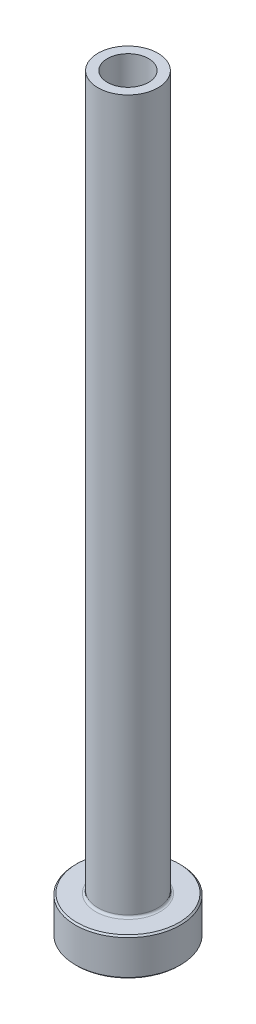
ISO-10303-21;
HEADER;
FILE_DESCRIPTION(('STEP AP214'),'2;1');
FILE_NAME('part.step','',(''),(''),'','','');
FILE_SCHEMA(('AUTOMOTIVE_DESIGN { 1 0 10303 214 1 1 1 1 }'));
ENDSEC;
DATA;
#1=APPLICATION_CONTEXT('core data for automotive mechanical design processes');
#2=APPLICATION_PROTOCOL_DEFINITION('international standard','automotive_design',2000,#1);
#3=PRODUCT_CONTEXT('',#1,'mechanical');
#4=PRODUCT('Part','Part','',(#3));
#5=PRODUCT_RELATED_PRODUCT_CATEGORY('part','',(#4));
#6=PRODUCT_DEFINITION_FORMATION('','',#4);
#7=PRODUCT_DEFINITION_CONTEXT('part definition',#1,'design');
#8=PRODUCT_DEFINITION('design','',#6,#7);
#9=PRODUCT_DEFINITION_SHAPE('','',#8);
#10=(LENGTH_UNIT() NAMED_UNIT(*) SI_UNIT(.MILLI.,.METRE.));
#11=(NAMED_UNIT(*) PLANE_ANGLE_UNIT() SI_UNIT($,.RADIAN.));
#12=(NAMED_UNIT(*) SI_UNIT($,.STERADIAN.) SOLID_ANGLE_UNIT());
#13=UNCERTAINTY_MEASURE_WITH_UNIT(LENGTH_MEASURE(1.E-05),#10,'distance_accuracy_value','');
#14=(GEOMETRIC_REPRESENTATION_CONTEXT(3) GLOBAL_UNCERTAINTY_ASSIGNED_CONTEXT((#13)) GLOBAL_UNIT_ASSIGNED_CONTEXT((#10,
#11,#12)) REPRESENTATION_CONTEXT('',''));
#15=CARTESIAN_POINT('',(0.,0.,0.));
#16=DIRECTION('',(0.,0.,1.));
#17=DIRECTION('',(1.,0.,0.));
#18=AXIS2_PLACEMENT_3D('',#15,#16,#17);
#19=CARTESIAN_POINT('',(0.,92.1876809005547,0.));
#20=DIRECTION('',(0.,1.,0.));
#21=DIRECTION('',(0.,0.,1.));
#22=AXIS2_PLACEMENT_3D('',#19,#20,#21);
#23=CYLINDRICAL_SURFACE('',#22,2.74999999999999);
#24=CARTESIAN_POINT('',(0.,100.,0.));
#25=DIRECTION('',(0.,1.,0.));
#26=DIRECTION('',(0.,0.,1.));
#27=AXIS2_PLACEMENT_3D('',#24,#25,#26);
#28=CIRCLE('',#27,2.74999999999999);
#29=CARTESIAN_POINT('',(0.,100.,2.74999999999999));
#30=VERTEX_POINT('',#29);
#31=EDGE_CURVE('E62',#30,#30,#28,.T.);
#32=ORIENTED_EDGE('',*,*,#31,.T.);
#33=EDGE_LOOP('',(#32));
#34=FACE_BOUND('',#33,.T.);
#35=CARTESIAN_POINT('',(0.,55.,0.));
#36=DIRECTION('',(0.,1.,0.));
#37=DIRECTION('',(0.,0.,1.));
#38=AXIS2_PLACEMENT_3D('',#35,#36,#37);
#39=CIRCLE('',#38,2.74999999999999);
#40=CARTESIAN_POINT('',(0.,55.,2.74999999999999));
#41=VERTEX_POINT('',#40);
#42=EDGE_CURVE('E71',#41,#41,#39,.T.);
#43=ORIENTED_EDGE('',*,*,#42,.F.);
#44=EDGE_LOOP('',(#43));
#45=FACE_BOUND('',#44,.T.);
#46=ADVANCED_FACE('F30',(#34,#45),#23,.F.);
#47=CARTESIAN_POINT('',(-2.74999999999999,100.,0.));
#48=DIRECTION('',(0.,1.,0.));
#49=DIRECTION('',(0.,0.,1.));
#50=AXIS2_PLACEMENT_3D('',#47,#48,#49);
#51=PLANE('',#50);
#52=CARTESIAN_POINT('',(0.,100.,0.));
#53=DIRECTION('',(0.,1.,0.));
#54=DIRECTION('',(0.,0.,1.));
#55=AXIS2_PLACEMENT_3D('',#52,#53,#54);
#56=CIRCLE('',#55,4.);
#57=CARTESIAN_POINT('',(0.,100.,4.));
#58=VERTEX_POINT('',#57);
#59=EDGE_CURVE('E65',#58,#58,#56,.T.);
#60=ORIENTED_EDGE('',*,*,#59,.T.);
#61=EDGE_LOOP('',(#60));
#62=FACE_BOUND('',#61,.T.);
#63=ORIENTED_EDGE('',*,*,#31,.F.);
#64=EDGE_LOOP('',(#63));
#65=FACE_BOUND('',#64,.T.);
#66=ADVANCED_FACE('F79',(#62,#65),#51,.T.);
#67=CARTESIAN_POINT('',(0.,92.1876809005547,0.));
#68=DIRECTION('',(0.,1.,0.));
#69=DIRECTION('',(0.,0.,1.));
#70=AXIS2_PLACEMENT_3D('',#67,#68,#69);
#71=CYLINDRICAL_SURFACE('',#70,4.);
#72=CARTESIAN_POINT('',(0.,5.3,0.));
#73=DIRECTION('',(0.,1.,0.));
#74=DIRECTION('',(0.,0.,1.));
#75=AXIS2_PLACEMENT_3D('',#72,#73,#74);
#76=CIRCLE('',#75,4.);
#77=CARTESIAN_POINT('',(0.,5.3,4.));
#78=VERTEX_POINT('',#77);
#79=EDGE_CURVE('E59',#78,#78,#76,.T.);
#80=ORIENTED_EDGE('',*,*,#79,.T.);
#81=EDGE_LOOP('',(#80));
#82=FACE_BOUND('',#81,.T.);
#83=ORIENTED_EDGE('',*,*,#59,.F.);
#84=EDGE_LOOP('',(#83));
#85=FACE_BOUND('',#84,.T.);
#86=ADVANCED_FACE('F85',(#82,#85),#71,.T.);
#87=CARTESIAN_POINT('',(-3.99999999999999,5.,0.));
#88=DIRECTION('',(0.,1.,0.));
#89=DIRECTION('',(0.,0.,1.));
#90=AXIS2_PLACEMENT_3D('',#87,#88,#89);
#91=PLANE('',#90);
#92=CARTESIAN_POINT('',(0.,5.,0.));
#93=DIRECTION('',(0.,1.,0.));
#94=DIRECTION('',(0.,0.,1.));
#95=AXIS2_PLACEMENT_3D('',#92,#93,#94);
#96=CIRCLE('',#95,6.79999999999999);
#97=CARTESIAN_POINT('',(0.,5.,6.79999999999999));
#98=VERTEX_POINT('',#97);
#99=EDGE_CURVE('E53',#98,#98,#96,.T.);
#100=ORIENTED_EDGE('',*,*,#99,.T.);
#101=EDGE_LOOP('',(#100));
#102=FACE_BOUND('',#101,.T.);
#103=CARTESIAN_POINT('',(0.,5.,0.));
#104=DIRECTION('',(0.,1.,0.));
#105=DIRECTION('',(0.,0.,1.));
#106=AXIS2_PLACEMENT_3D('',#103,#104,#105);
#107=CIRCLE('',#106,4.3);
#108=CARTESIAN_POINT('',(0.,5.,4.3));
#109=VERTEX_POINT('',#108);
#110=EDGE_CURVE('E56',#109,#109,#107,.F.);
#111=ORIENTED_EDGE('',*,*,#110,.T.);
#112=EDGE_LOOP('',(#111));
#113=FACE_BOUND('',#112,.T.);
#114=ADVANCED_FACE('F111',(#102,#113),#91,.T.);
#115=CARTESIAN_POINT('',(0.,92.1876809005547,0.));
#116=DIRECTION('',(0.,1.,0.));
#117=DIRECTION('',(0.,0.,1.));
#118=AXIS2_PLACEMENT_3D('',#115,#116,#117);
#119=CYLINDRICAL_SURFACE('',#118,6.99999999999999);
#120=CARTESIAN_POINT('',(0.,4.8,0.));
#121=DIRECTION('',(0.,1.,0.));
#122=DIRECTION('',(0.,0.,1.));
#123=AXIS2_PLACEMENT_3D('',#120,#121,#122);
#124=CIRCLE('',#123,6.99999999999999);
#125=CARTESIAN_POINT('',(0.,4.8,6.99999999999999));
#126=VERTEX_POINT('',#125);
#127=EDGE_CURVE('E45',#126,#126,#124,.F.);
#128=ORIENTED_EDGE('',*,*,#127,.T.);
#129=EDGE_LOOP('',(#128));
#130=FACE_BOUND('',#129,.T.);
#131=CARTESIAN_POINT('',(0.,0.199999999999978,0.));
#132=DIRECTION('',(0.,-1.,0.));
#133=DIRECTION('',(0.,0.,-1.));
#134=AXIS2_PLACEMENT_3D('',#131,#132,#133);
#135=CIRCLE('',#134,6.99999999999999);
#136=CARTESIAN_POINT('',(0.,0.199999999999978,6.99999999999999));
#137=VERTEX_POINT('',#136);
#138=EDGE_CURVE('E50',#137,#137,#135,.F.);
#139=ORIENTED_EDGE('',*,*,#138,.T.);
#140=EDGE_LOOP('',(#139));
#141=FACE_BOUND('',#140,.T.);
#142=ADVANCED_FACE('F108',(#130,#141),#119,.T.);
#143=CARTESIAN_POINT('',(-6.99999999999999,0.,0.));
#144=DIRECTION('',(0.,-1.,0.));
#145=DIRECTION('',(0.,0.,-1.));
#146=AXIS2_PLACEMENT_3D('',#143,#144,#145);
#147=PLANE('',#146);
#148=CARTESIAN_POINT('',(0.,0.,0.));
#149=DIRECTION('',(0.,-1.,0.));
#150=DIRECTION('',(0.,0.,-1.));
#151=AXIS2_PLACEMENT_3D('',#148,#149,#150);
#152=CIRCLE('',#151,3.49999999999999);
#153=CARTESIAN_POINT('',(0.,0.,-3.49999999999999));
#154=VERTEX_POINT('',#153);
#155=EDGE_CURVE('E37',#154,#154,#152,.F.);
#156=ORIENTED_EDGE('',*,*,#155,.T.);
#157=EDGE_LOOP('',(#156));
#158=FACE_BOUND('',#157,.T.);
#159=CARTESIAN_POINT('',(0.,0.,0.));
#160=DIRECTION('',(0.,-1.,0.));
#161=DIRECTION('',(0.,0.,-1.));
#162=AXIS2_PLACEMENT_3D('',#159,#160,#161);
#163=CIRCLE('',#162,6.80000000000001);
#164=CARTESIAN_POINT('',(0.,0.,6.80000000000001));
#165=VERTEX_POINT('',#164);
#166=EDGE_CURVE('E41',#165,#165,#163,.T.);
#167=ORIENTED_EDGE('',*,*,#166,.T.);
#168=EDGE_LOOP('',(#167));
#169=FACE_BOUND('',#168,.T.);
#170=ADVANCED_FACE('F110',(#158,#169),#147,.T.);
#171=CARTESIAN_POINT('',(0.,92.1876809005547,0.));
#172=DIRECTION('',(0.,1.,0.));
#173=DIRECTION('',(0.,0.,1.));
#174=AXIS2_PLACEMENT_3D('',#171,#172,#173);
#175=CYLINDRICAL_SURFACE('',#174,2.99999999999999);
#176=CARTESIAN_POINT('',(0.,0.5,0.));
#177=DIRECTION('',(0.,-1.,0.));
#178=DIRECTION('',(0.,0.,-1.));
#179=AXIS2_PLACEMENT_3D('',#176,#177,#178);
#180=CIRCLE('',#179,2.99999999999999);
#181=CARTESIAN_POINT('',(0.,0.5,-2.99999999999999));
#182=VERTEX_POINT('',#181);
#183=EDGE_CURVE('E10',#182,#182,#180,.T.);
#184=ORIENTED_EDGE('',*,*,#183,.T.);
#185=EDGE_LOOP('',(#184));
#186=FACE_BOUND('',#185,.T.);
#187=CARTESIAN_POINT('',(0.,43.,0.));
#188=DIRECTION('',(0.,1.,0.));
#189=DIRECTION('',(0.,0.,1.));
#190=AXIS2_PLACEMENT_3D('',#187,#188,#189);
#191=CIRCLE('',#190,3.);
#192=CARTESIAN_POINT('',(0.,43.,3.));
#193=VERTEX_POINT('',#192);
#194=EDGE_CURVE('E68',#193,#193,#191,.T.);
#195=ORIENTED_EDGE('',*,*,#194,.T.);
#196=EDGE_LOOP('',(#195));
#197=FACE_BOUND('',#196,.T.);
#198=ADVANCED_FACE('F118',(#186,#197),#175,.F.);
#199=CARTESIAN_POINT('',(0.,43.,0.));
#200=DIRECTION('',(0.,-1.,0.));
#201=DIRECTION('',(0.,0.,-1.));
#202=AXIS2_PLACEMENT_3D('',#199,#200,#201);
#203=CONICAL_SURFACE('',#202,3.,0.0208303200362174);
#204=ORIENTED_EDGE('',*,*,#42,.T.);
#205=EDGE_LOOP('',(#204));
#206=FACE_BOUND('',#205,.T.);
#207=ORIENTED_EDGE('',*,*,#194,.F.);
#208=EDGE_LOOP('',(#207));
#209=FACE_BOUND('',#208,.T.);
#210=ADVANCED_FACE('F75',(#206,#209),#203,.F.);
#211=CARTESIAN_POINT('',(0.,5.3,0.));
#212=DIRECTION('',(0.,1.,0.));
#213=DIRECTION('',(0.,0.,1.));
#214=AXIS2_PLACEMENT_3D('',#211,#212,#213);
#215=TOROIDAL_SURFACE('',#214,4.3,0.3);
#216=ORIENTED_EDGE('',*,*,#110,.F.);
#217=EDGE_LOOP('',(#216));
#218=FACE_BOUND('',#217,.T.);
#219=ORIENTED_EDGE('',*,*,#79,.F.);
#220=EDGE_LOOP('',(#219));
#221=FACE_BOUND('',#220,.T.);
#222=ADVANCED_FACE('F90',(#218,#221),#215,.F.);
#223=CARTESIAN_POINT('',(0.,5.,0.));
#224=DIRECTION('',(0.,-1.,0.));
#225=DIRECTION('',(0.,0.,-1.));
#226=AXIS2_PLACEMENT_3D('',#223,#224,#225);
#227=CONICAL_SURFACE('',#226,6.79999999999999,0.78539816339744);
#228=ORIENTED_EDGE('',*,*,#127,.F.);
#229=EDGE_LOOP('',(#228));
#230=FACE_BOUND('',#229,.T.);
#231=ORIENTED_EDGE('',*,*,#99,.F.);
#232=EDGE_LOOP('',(#231));
#233=FACE_BOUND('',#232,.T.);
#234=ADVANCED_FACE('F93',(#230,#233),#227,.T.);
#235=CARTESIAN_POINT('',(0.,0.199999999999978,0.));
#236=DIRECTION('',(0.,1.,0.));
#237=DIRECTION('',(0.,0.,1.));
#238=AXIS2_PLACEMENT_3D('',#235,#236,#237);
#239=CONICAL_SURFACE('',#238,6.99999999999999,0.78539816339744);
#240=CARTESIAN_POINT('',(0.,0.,6.80000000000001));
#241=CARTESIAN_POINT('',(0.,0.00208333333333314,6.80208333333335));
#242=CARTESIAN_POINT('',(0.,0.00416666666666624,6.80416666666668));
#243=CARTESIAN_POINT('',(0.,0.00833333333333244,6.80833333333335));
#244=CARTESIAN_POINT('',(0.,0.0104166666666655,6.81041666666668));
#245=CARTESIAN_POINT('',(0.,0.0145833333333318,6.81458333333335));
#246=CARTESIAN_POINT('',(0.,0.0166666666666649,6.81666666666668));
#247=CARTESIAN_POINT('',(0.,0.020833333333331,6.82083333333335));
#248=CARTESIAN_POINT('',(0.,0.0229166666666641,6.82291666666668));
#249=CARTESIAN_POINT('',(0.,0.0270833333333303,6.82708333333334));
#250=CARTESIAN_POINT('',(0.,0.0291666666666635,6.82916666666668));
#251=CARTESIAN_POINT('',(0.,0.0333333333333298,6.83333333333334));
#252=CARTESIAN_POINT('',(0.,0.0354166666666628,6.83541666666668));
#253=CARTESIAN_POINT('',(0.,0.039583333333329,6.83958333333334));
#254=CARTESIAN_POINT('',(0.,0.0416666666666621,6.84166666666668));
#255=CARTESIAN_POINT('',(0.,0.0458333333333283,6.84583333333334));
#256=CARTESIAN_POINT('',(0.,0.0479166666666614,6.84791666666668));
#257=CARTESIAN_POINT('',(0.,0.0520833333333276,6.85208333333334));
#258=CARTESIAN_POINT('',(0.,0.0541666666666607,6.85416666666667));
#259=CARTESIAN_POINT('',(0.,0.0583333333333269,6.85833333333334));
#260=CARTESIAN_POINT('',(0.,0.0604166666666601,6.86041666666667));
#261=CARTESIAN_POINT('',(0.,0.0645833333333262,6.86458333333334));
#262=CARTESIAN_POINT('',(0.,0.0666666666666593,6.86666666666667));
#263=CARTESIAN_POINT('',(0.,0.0708333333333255,6.87083333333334));
#264=CARTESIAN_POINT('',(0.,0.0729166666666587,6.87291666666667));
#265=CARTESIAN_POINT('',(0.,0.077083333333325,6.87708333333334));
#266=CARTESIAN_POINT('',(0.,0.079166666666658,6.87916666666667));
#267=CARTESIAN_POINT('',(0.,0.0833333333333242,6.88333333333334));
#268=CARTESIAN_POINT('',(0.,0.0854166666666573,6.88541666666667));
#269=CARTESIAN_POINT('',(0.,0.0895833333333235,6.88958333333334));
#270=CARTESIAN_POINT('',(0.,0.0916666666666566,6.89166666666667));
#271=CARTESIAN_POINT('',(0.,0.0958333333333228,6.89583333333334));
#272=CARTESIAN_POINT('',(0.,0.0979166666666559,6.89791666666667));
#273=CARTESIAN_POINT('',(0.,0.102083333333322,6.90208333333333));
#274=CARTESIAN_POINT('',(0.,0.104166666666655,6.90416666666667));
#275=CARTESIAN_POINT('',(0.,0.108333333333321,6.90833333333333));
#276=CARTESIAN_POINT('',(0.,0.110416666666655,6.91041666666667));
#277=CARTESIAN_POINT('',(0.,0.114583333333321,6.91458333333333));
#278=CARTESIAN_POINT('',(0.,0.116666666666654,6.91666666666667));
#279=CARTESIAN_POINT('',(0.,0.12083333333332,6.92083333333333));
#280=CARTESIAN_POINT('',(0.,0.122916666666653,6.92291666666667));
#281=CARTESIAN_POINT('',(0.,0.127083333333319,6.92708333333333));
#282=CARTESIAN_POINT('',(0.,0.129166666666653,6.92916666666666));
#283=CARTESIAN_POINT('',(0.,0.133333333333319,6.93333333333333));
#284=CARTESIAN_POINT('',(0.,0.135416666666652,6.93541666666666));
#285=CARTESIAN_POINT('',(0.,0.139583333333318,6.93958333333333));
#286=CARTESIAN_POINT('',(0.,0.141666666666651,6.94166666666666));
#287=CARTESIAN_POINT('',(0.,0.145833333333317,6.94583333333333));
#288=CARTESIAN_POINT('',(0.,0.14791666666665,6.94791666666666));
#289=CARTESIAN_POINT('',(0.,0.152083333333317,6.95208333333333));
#290=CARTESIAN_POINT('',(0.,0.15416666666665,6.95416666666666));
#291=CARTESIAN_POINT('',(0.,0.158333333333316,6.95833333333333));
#292=CARTESIAN_POINT('',(0.,0.160416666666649,6.96041666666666));
#293=CARTESIAN_POINT('',(0.,0.164583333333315,6.96458333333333));
#294=CARTESIAN_POINT('',(0.,0.166666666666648,6.96666666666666));
#295=CARTESIAN_POINT('',(0.,0.170833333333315,6.97083333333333));
#296=CARTESIAN_POINT('',(0.,0.172916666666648,6.97291666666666));
#297=CARTESIAN_POINT('',(0.,0.177083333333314,6.97708333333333));
#298=CARTESIAN_POINT('',(0.,0.179166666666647,6.97916666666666));
#299=CARTESIAN_POINT('',(0.,0.183333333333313,6.98333333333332));
#300=CARTESIAN_POINT('',(0.,0.185416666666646,6.98541666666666));
#301=CARTESIAN_POINT('',(0.,0.189583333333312,6.98958333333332));
#302=CARTESIAN_POINT('',(0.,0.191666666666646,6.99166666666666));
#303=CARTESIAN_POINT('',(0.,0.195833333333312,6.99583333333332));
#304=CARTESIAN_POINT('',(0.,0.197916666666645,6.99791666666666));
#305=CARTESIAN_POINT('',(0.,0.199999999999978,6.99999999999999));
#306=B_SPLINE_CURVE_WITH_KNOTS('',3,(#240,#241,#242,#243,#244,#245,#246,#247,#248,#249,#250,
#251,#252,#253,#254,#255,#256,#257,#258,#259,#260,#261,#262,#263,#264,#265,#266,#267,#268,#269,
#270,#271,#272,#273,#274,#275,#276,#277,#278,#279,#280,#281,#282,#283,#284,#285,#286,#287,#288,
#289,#290,#291,#292,#293,#294,#295,#296,#297,#298,#299,#300,#301,#302,#303,#304,#305),
.UNSPECIFIED.,.F.,.F.,(4,2,2,2,2,2,2,2,2,2,2,2,2,2,2,2,2,2,2,2,2,2,2,2,2,2,2,2,2,2,2,2,4),(0.,
0.00883883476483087,0.0176776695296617,0.0265165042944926,0.0353553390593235,0.0441941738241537,
0.0530330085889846,0.0618718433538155,0.0707106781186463,0.0795495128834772,0.0883883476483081,
0.0972271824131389,0.106066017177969,0.1149048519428,0.123743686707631,0.132582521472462,
0.141421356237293,0.150260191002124,0.159099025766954,0.167937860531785,0.176776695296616,
0.185615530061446,0.194454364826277,0.203293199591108,0.212132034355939,0.22097086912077,
0.229809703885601,0.238648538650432,0.247487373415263,0.256326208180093,0.265165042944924,
0.274003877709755,0.282842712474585),.UNSPECIFIED.);
#307=EDGE_CURVE('BSEAM96',#165,#137,#306,.T.);
#308=ORIENTED_EDGE('',*,*,#166,.F.);
#309=ORIENTED_EDGE('',*,*,#138,.F.);
#310=ORIENTED_EDGE('',*,*,#307,.T.);
#311=ORIENTED_EDGE('',*,*,#307,.F.);
#312=EDGE_LOOP('',(#308,#310,#309,#311));
#313=FACE_BOUND('',#312,.T.);
#314=ADVANCED_FACE('F96',(#313),#239,.T.);
#315=CARTESIAN_POINT('',(0.,0.,0.));
#316=DIRECTION('',(0.,-1.,0.));
#317=DIRECTION('',(0.,0.,-1.));
#318=AXIS2_PLACEMENT_3D('',#315,#316,#317);
#319=CONICAL_SURFACE('',#318,3.49999999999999,0.785398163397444);
#320=ORIENTED_EDGE('',*,*,#183,.F.);
#321=EDGE_LOOP('',(#320));
#322=FACE_BOUND('',#321,.T.);
#323=ORIENTED_EDGE('',*,*,#155,.F.);
#324=EDGE_LOOP('',(#323));
#325=FACE_BOUND('',#324,.T.);
#326=ADVANCED_FACE('F32',(#322,#325),#319,.F.);
#327=CLOSED_SHELL('',(#46,#66,#86,#114,#142,#170,#198,#210,#222,#234,#314,#326));
#328=MANIFOLD_SOLID_BREP('B2',#327);
#329=ADVANCED_BREP_SHAPE_REPRESENTATION('',(#18,#328),#14);
#330=SHAPE_DEFINITION_REPRESENTATION(#9,#329);
ENDSEC;
END-ISO-10303-21;
